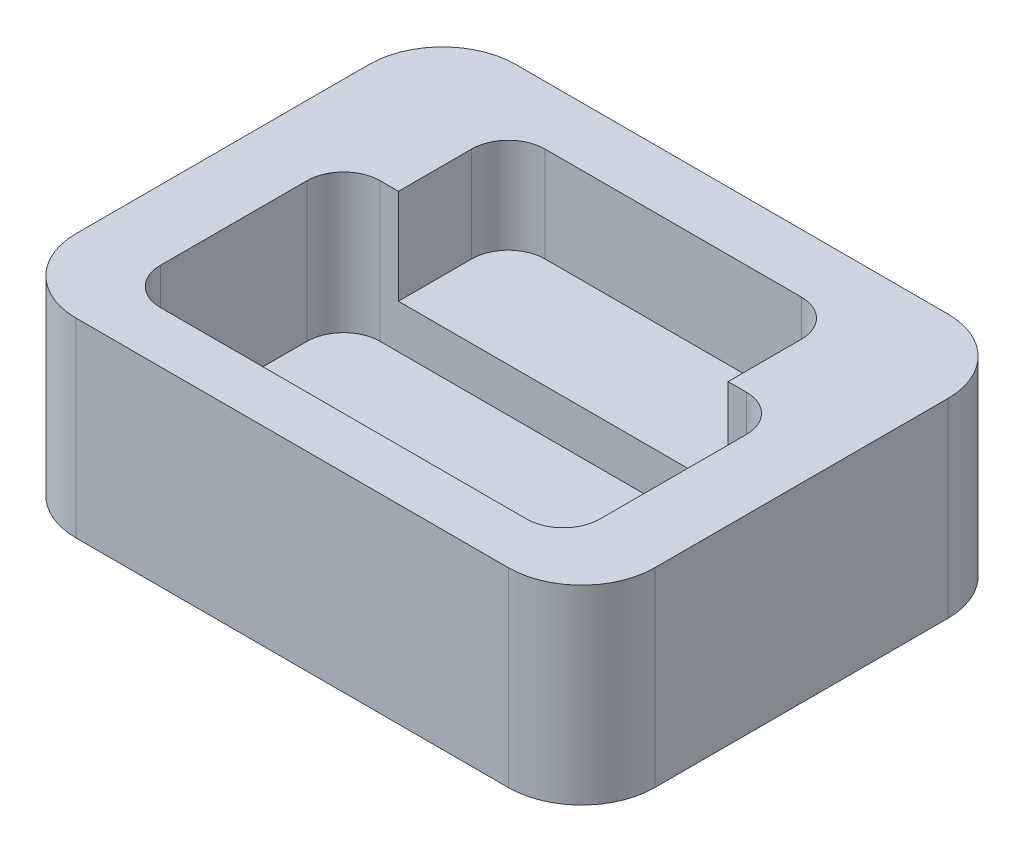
ISO-10303-21;
HEADER;
FILE_DESCRIPTION(('STEP AP214'),'2;1');
FILE_NAME('part.step','',(''),(''),'','','');
FILE_SCHEMA(('AUTOMOTIVE_DESIGN { 1 0 10303 214 1 1 1 1 }'));
ENDSEC;
DATA;
#1=APPLICATION_CONTEXT('core data for automotive mechanical design processes');
#2=APPLICATION_PROTOCOL_DEFINITION('international standard','automotive_design',2000,#1);
#3=PRODUCT_CONTEXT('',#1,'mechanical');
#4=PRODUCT('Part','Part','',(#3));
#5=PRODUCT_RELATED_PRODUCT_CATEGORY('part','',(#4));
#6=PRODUCT_DEFINITION_FORMATION('','',#4);
#7=PRODUCT_DEFINITION_CONTEXT('part definition',#1,'design');
#8=PRODUCT_DEFINITION('design','',#6,#7);
#9=PRODUCT_DEFINITION_SHAPE('','',#8);
#10=(LENGTH_UNIT() NAMED_UNIT(*) SI_UNIT(.MILLI.,.METRE.));
#11=(NAMED_UNIT(*) PLANE_ANGLE_UNIT() SI_UNIT($,.RADIAN.));
#12=(NAMED_UNIT(*) SI_UNIT($,.STERADIAN.) SOLID_ANGLE_UNIT());
#13=UNCERTAINTY_MEASURE_WITH_UNIT(LENGTH_MEASURE(1.E-05),#10,'distance_accuracy_value','');
#14=(GEOMETRIC_REPRESENTATION_CONTEXT(3) GLOBAL_UNCERTAINTY_ASSIGNED_CONTEXT((#13)) GLOBAL_UNIT_ASSIGNED_CONTEXT((#10,
#11,#12)) REPRESENTATION_CONTEXT('',''));
#15=CARTESIAN_POINT('',(0.,0.,0.));
#16=DIRECTION('',(0.,0.,1.));
#17=DIRECTION('',(1.,0.,0.));
#18=AXIS2_PLACEMENT_3D('',#15,#16,#17);
#19=CARTESIAN_POINT('',(0.,26.,0.));
#20=DIRECTION('',(0.,1.,0.));
#21=DIRECTION('',(0.,0.,1.));
#22=AXIS2_PLACEMENT_3D('',#19,#20,#21);
#23=PLANE('',#22);
#24=DIRECTION('',(0.,0.,-1.));
#25=VECTOR('',#24,1.);
#26=CARTESIAN_POINT('',(25.6279926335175,26.,0.));
#27=LINE('',#26,#25);
#28=CARTESIAN_POINT('',(25.6279926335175,26.,7.9419889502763));
#29=VERTEX_POINT('',#28);
#30=CARTESIAN_POINT('',(25.6279926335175,26.,-2.05801104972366));
#31=VERTEX_POINT('',#30);
#32=EDGE_CURVE('E303',#29,#31,#27,.T.);
#33=ORIENTED_EDGE('',*,*,#32,.F.);
#34=DIRECTION('',(-1.,0.,0.));
#35=VECTOR('',#34,1.);
#36=CARTESIAN_POINT('',(0.,26.,7.9419889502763));
#37=LINE('',#36,#35);
#38=CARTESIAN_POINT('',(28.1279926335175,26.,7.9419889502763));
#39=VERTEX_POINT('',#38);
#40=EDGE_CURVE('E334',#39,#29,#37,.T.);
#41=ORIENTED_EDGE('',*,*,#40,.F.);
#42=CARTESIAN_POINT('',(28.1279926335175,26.,12.9419889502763));
#43=DIRECTION('',(0.,1.,0.));
#44=DIRECTION('',(0.,0.,1.));
#45=AXIS2_PLACEMENT_3D('',#42,#43,#44);
#46=CIRCLE('',#45,5.);
#47=CARTESIAN_POINT('',(33.1279926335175,26.,12.9419889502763));
#48=VERTEX_POINT('',#47);
#49=EDGE_CURVE('E330',#48,#39,#46,.T.);
#50=ORIENTED_EDGE('',*,*,#49,.F.);
#51=DIRECTION('',(0.,0.,-1.));
#52=VECTOR('',#51,1.);
#53=CARTESIAN_POINT('',(33.1279926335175,26.,0.));
#54=LINE('',#53,#52);
#55=CARTESIAN_POINT('',(33.1279926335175,26.,32.9419889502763));
#56=VERTEX_POINT('',#55);
#57=EDGE_CURVE('E327',#56,#48,#54,.T.);
#58=ORIENTED_EDGE('',*,*,#57,.F.);
#59=CARTESIAN_POINT('',(28.1279926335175,26.,32.9419889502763));
#60=DIRECTION('',(0.,1.,0.));
#61=DIRECTION('',(0.,0.,1.));
#62=AXIS2_PLACEMENT_3D('',#59,#60,#61);
#63=CIRCLE('',#62,5.);
#64=CARTESIAN_POINT('',(28.1279926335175,26.,37.9419889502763));
#65=VERTEX_POINT('',#64);
#66=EDGE_CURVE('E325',#65,#56,#63,.T.);
#67=ORIENTED_EDGE('',*,*,#66,.F.);
#68=DIRECTION('',(-1.,0.,0.));
#69=VECTOR('',#68,1.);
#70=CARTESIAN_POINT('',(0.,26.,37.9419889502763));
#71=LINE('',#70,#69);
#72=CARTESIAN_POINT('',(-21.8720073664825,26.,37.9419889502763));
#73=VERTEX_POINT('',#72);
#74=EDGE_CURVE('E116',#65,#73,#71,.T.);
#75=ORIENTED_EDGE('',*,*,#74,.T.);
#76=CARTESIAN_POINT('',(-21.8720073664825,26.,32.9419889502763));
#77=DIRECTION('',(0.,1.,0.));
#78=DIRECTION('',(0.,0.,1.));
#79=AXIS2_PLACEMENT_3D('',#76,#77,#78);
#80=CIRCLE('',#79,5.);
#81=CARTESIAN_POINT('',(-26.8720073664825,26.,32.9419889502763));
#82=VERTEX_POINT('',#81);
#83=EDGE_CURVE('E249',#73,#82,#80,.F.);
#84=ORIENTED_EDGE('',*,*,#83,.T.);
#85=DIRECTION('',(0.,0.,-1.));
#86=VECTOR('',#85,1.);
#87=CARTESIAN_POINT('',(-26.8720073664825,26.,0.));
#88=LINE('',#87,#86);
#89=CARTESIAN_POINT('',(-26.8720073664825,26.,12.9419889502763));
#90=VERTEX_POINT('',#89);
#91=EDGE_CURVE('E340',#82,#90,#88,.T.);
#92=ORIENTED_EDGE('',*,*,#91,.T.);
#93=CARTESIAN_POINT('',(-21.8720073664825,26.,12.9419889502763));
#94=DIRECTION('',(0.,1.,0.));
#95=DIRECTION('',(0.,0.,1.));
#96=AXIS2_PLACEMENT_3D('',#93,#94,#95);
#97=CIRCLE('',#96,5.);
#98=CARTESIAN_POINT('',(-21.8720073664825,26.,7.94198895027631));
#99=VERTEX_POINT('',#98);
#100=EDGE_CURVE('E337',#90,#99,#97,.F.);
#101=ORIENTED_EDGE('',*,*,#100,.T.);
#102=CARTESIAN_POINT('',(-19.3720073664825,26.,7.94198895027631));
#103=VERTEX_POINT('',#102);
#104=EDGE_CURVE('E333',#103,#99,#37,.T.);
#105=ORIENTED_EDGE('',*,*,#104,.F.);
#106=DIRECTION('',(0.,0.,-1.));
#107=VECTOR('',#106,1.);
#108=CARTESIAN_POINT('',(-19.3720073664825,26.,0.));
#109=LINE('',#108,#107);
#110=CARTESIAN_POINT('',(-19.3720073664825,26.,-2.05801104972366));
#111=VERTEX_POINT('',#110);
#112=EDGE_CURVE('E300',#103,#111,#109,.T.);
#113=ORIENTED_EDGE('',*,*,#112,.T.);
#114=CARTESIAN_POINT('',(-14.3720073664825,26.,-2.05801104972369));
#115=DIRECTION('',(0.,1.,0.));
#116=DIRECTION('',(0.,0.,1.));
#117=AXIS2_PLACEMENT_3D('',#114,#115,#116);
#118=CIRCLE('',#117,5.);
#119=CARTESIAN_POINT('',(-14.3720073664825,26.,-7.05801104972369));
#120=VERTEX_POINT('',#119);
#121=EDGE_CURVE('E280',#111,#120,#118,.F.);
#122=ORIENTED_EDGE('',*,*,#121,.T.);
#123=DIRECTION('',(1.,0.,0.));
#124=VECTOR('',#123,1.);
#125=CARTESIAN_POINT('',(0.,26.,-7.05801104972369));
#126=LINE('',#125,#124);
#127=CARTESIAN_POINT('',(20.6279926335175,26.,-7.05801104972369));
#128=VERTEX_POINT('',#127);
#129=EDGE_CURVE('E284',#120,#128,#126,.T.);
#130=ORIENTED_EDGE('',*,*,#129,.T.);
#131=CARTESIAN_POINT('',(20.6279926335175,26.,-2.05801104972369));
#132=DIRECTION('',(0.,1.,0.));
#133=DIRECTION('',(0.,0.,1.));
#134=AXIS2_PLACEMENT_3D('',#131,#132,#133);
#135=CIRCLE('',#134,5.);
#136=EDGE_CURVE('E306',#31,#128,#135,.T.);
#137=ORIENTED_EDGE('',*,*,#136,.F.);
#138=EDGE_LOOP('',(#33,#41,#50,#58,#67,#75,#84,#92,#101,#105,#113,#122,#130,#137));
#139=FACE_BOUND('',#138,.T.);
#140=CARTESIAN_POINT('',(-26.3720073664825,26.,-5.0580110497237));
#141=DIRECTION('',(0.,1.,0.));
#142=DIRECTION('',(0.,0.,1.));
#143=AXIS2_PLACEMENT_3D('',#140,#141,#142);
#144=CIRCLE('',#143,10.);
#145=CARTESIAN_POINT('',(-36.3720073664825,26.,-5.05801104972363));
#146=VERTEX_POINT('',#145);
#147=CARTESIAN_POINT('',(-26.3720073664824,26.,-15.0580110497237));
#148=VERTEX_POINT('',#147);
#149=EDGE_CURVE('E360',#146,#148,#144,.F.);
#150=ORIENTED_EDGE('',*,*,#149,.F.);
#151=DIRECTION('',(0.,0.,1.));
#152=VECTOR('',#151,1.);
#153=CARTESIAN_POINT('',(-36.3720073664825,26.,0.));
#154=LINE('',#153,#152);
#155=CARTESIAN_POINT('',(-36.3720073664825,26.,34.9419889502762));
#156=VERTEX_POINT('',#155);
#157=EDGE_CURVE('E363',#146,#156,#154,.T.);
#158=ORIENTED_EDGE('',*,*,#157,.T.);
#159=CARTESIAN_POINT('',(-26.3720073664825,26.,34.9419889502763));
#160=DIRECTION('',(0.,1.,0.));
#161=DIRECTION('',(0.,0.,1.));
#162=AXIS2_PLACEMENT_3D('',#159,#160,#161);
#163=CIRCLE('',#162,10.);
#164=CARTESIAN_POINT('',(-26.3720073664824,26.,44.9419889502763));
#165=VERTEX_POINT('',#164);
#166=EDGE_CURVE('E366',#156,#165,#163,.T.);
#167=ORIENTED_EDGE('',*,*,#166,.T.);
#168=DIRECTION('',(1.,0.,0.));
#169=VECTOR('',#168,1.);
#170=CARTESIAN_POINT('',(0.,26.,44.9419889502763));
#171=LINE('',#170,#169);
#172=CARTESIAN_POINT('',(32.6279926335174,26.,44.9419889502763));
#173=VERTEX_POINT('',#172);
#174=EDGE_CURVE('E368',#165,#173,#171,.T.);
#175=ORIENTED_EDGE('',*,*,#174,.T.);
#176=CARTESIAN_POINT('',(32.6279926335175,26.,34.9419889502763));
#177=DIRECTION('',(0.,1.,0.));
#178=DIRECTION('',(0.,0.,1.));
#179=AXIS2_PLACEMENT_3D('',#176,#177,#178);
#180=CIRCLE('',#179,10.);
#181=CARTESIAN_POINT('',(42.6279926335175,26.,34.9419889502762));
#182=VERTEX_POINT('',#181);
#183=EDGE_CURVE('E370',#173,#182,#180,.T.);
#184=ORIENTED_EDGE('',*,*,#183,.T.);
#185=DIRECTION('',(0.,0.,1.));
#186=VECTOR('',#185,1.);
#187=CARTESIAN_POINT('',(42.6279926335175,26.,0.));
#188=LINE('',#187,#186);
#189=CARTESIAN_POINT('',(42.6279926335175,26.,-5.05801104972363));
#190=VERTEX_POINT('',#189);
#191=EDGE_CURVE('E372',#190,#182,#188,.T.);
#192=ORIENTED_EDGE('',*,*,#191,.F.);
#193=CARTESIAN_POINT('',(32.6279926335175,26.,-5.0580110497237));
#194=DIRECTION('',(0.,1.,0.));
#195=DIRECTION('',(0.,0.,1.));
#196=AXIS2_PLACEMENT_3D('',#193,#194,#195);
#197=CIRCLE('',#196,10.);
#198=CARTESIAN_POINT('',(32.6279926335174,26.,-15.0580110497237));
#199=VERTEX_POINT('',#198);
#200=EDGE_CURVE('E375',#190,#199,#197,.T.);
#201=ORIENTED_EDGE('',*,*,#200,.T.);
#202=DIRECTION('',(1.,0.,0.));
#203=VECTOR('',#202,1.);
#204=CARTESIAN_POINT('',(0.,26.,-15.0580110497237));
#205=LINE('',#204,#203);
#206=EDGE_CURVE('E377',#148,#199,#205,.T.);
#207=ORIENTED_EDGE('',*,*,#206,.F.);
#208=EDGE_LOOP('',(#150,#158,#167,#175,#184,#192,#201,#207));
#209=FACE_BOUND('',#208,.T.);
#210=ADVANCED_FACE('F93',(#139,#209),#23,.T.);
#211=CARTESIAN_POINT('',(0.,26.,-15.0580110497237));
#212=DIRECTION('',(0.,0.,-1.));
#213=DIRECTION('',(-1.,0.,0.));
#214=AXIS2_PLACEMENT_3D('',#211,#212,#213);
#215=PLANE('',#214);
#216=DIRECTION('',(1.,0.,0.));
#217=VECTOR('',#216,1.);
#218=CARTESIAN_POINT('',(0.,0.,-15.0580110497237));
#219=LINE('',#218,#217);
#220=CARTESIAN_POINT('',(-26.3720073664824,0.,-15.0580110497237));
#221=VERTEX_POINT('',#220);
#222=CARTESIAN_POINT('',(32.6279926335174,0.,-15.0580110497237));
#223=VERTEX_POINT('',#222);
#224=EDGE_CURVE('E364',#221,#223,#219,.T.);
#225=ORIENTED_EDGE('',*,*,#224,.F.);
#226=DIRECTION('',(0.,-1.,0.));
#227=VECTOR('',#226,1.);
#228=CARTESIAN_POINT('',(-26.3720073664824,26.,-15.0580110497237));
#229=LINE('',#228,#227);
#230=EDGE_CURVE('E380',#148,#221,#229,.T.);
#231=ORIENTED_EDGE('',*,*,#230,.F.);
#232=ORIENTED_EDGE('',*,*,#206,.T.);
#233=DIRECTION('',(0.,-1.,0.));
#234=VECTOR('',#233,1.);
#235=CARTESIAN_POINT('',(32.6279926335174,26.,-15.0580110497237));
#236=LINE('',#235,#234);
#237=EDGE_CURVE('E401',#199,#223,#236,.T.);
#238=ORIENTED_EDGE('',*,*,#237,.T.);
#239=EDGE_LOOP('',(#225,#231,#232,#238));
#240=FACE_BOUND('',#239,.T.);
#241=ADVANCED_FACE('F444',(#240),#215,.T.);
#242=CARTESIAN_POINT('',(0.,0.,0.));
#243=DIRECTION('',(0.,1.,0.));
#244=DIRECTION('',(0.,0.,1.));
#245=AXIS2_PLACEMENT_3D('',#242,#243,#244);
#246=PLANE('',#245);
#247=CARTESIAN_POINT('',(-26.3720073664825,0.,-5.0580110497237));
#248=DIRECTION('',(0.,1.,0.));
#249=DIRECTION('',(0.,0.,1.));
#250=AXIS2_PLACEMENT_3D('',#247,#248,#249);
#251=CIRCLE('',#250,10.);
#252=CARTESIAN_POINT('',(-36.3720073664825,0.,-5.05801104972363));
#253=VERTEX_POINT('',#252);
#254=EDGE_CURVE('E347',#253,#221,#251,.F.);
#255=ORIENTED_EDGE('',*,*,#254,.T.);
#256=ORIENTED_EDGE('',*,*,#224,.T.);
#257=CARTESIAN_POINT('',(32.6279926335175,0.,-5.0580110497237));
#258=DIRECTION('',(0.,1.,0.));
#259=DIRECTION('',(0.,0.,1.));
#260=AXIS2_PLACEMENT_3D('',#257,#258,#259);
#261=CIRCLE('',#260,10.);
#262=CARTESIAN_POINT('',(42.6279926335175,0.,-5.05801104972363));
#263=VERTEX_POINT('',#262);
#264=EDGE_CURVE('E395',#263,#223,#261,.T.);
#265=ORIENTED_EDGE('',*,*,#264,.F.);
#266=DIRECTION('',(0.,0.,1.));
#267=VECTOR('',#266,1.);
#268=CARTESIAN_POINT('',(42.6279926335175,0.,0.));
#269=LINE('',#268,#267);
#270=CARTESIAN_POINT('',(42.6279926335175,0.,34.9419889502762));
#271=VERTEX_POINT('',#270);
#272=EDGE_CURVE('E392',#263,#271,#269,.T.);
#273=ORIENTED_EDGE('',*,*,#272,.T.);
#274=CARTESIAN_POINT('',(32.6279926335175,0.,34.9419889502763));
#275=DIRECTION('',(0.,1.,0.));
#276=DIRECTION('',(0.,0.,1.));
#277=AXIS2_PLACEMENT_3D('',#274,#275,#276);
#278=CIRCLE('',#277,10.);
#279=CARTESIAN_POINT('',(32.6279926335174,0.,44.9419889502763));
#280=VERTEX_POINT('',#279);
#281=EDGE_CURVE('E389',#280,#271,#278,.T.);
#282=ORIENTED_EDGE('',*,*,#281,.F.);
#283=DIRECTION('',(1.,0.,0.));
#284=VECTOR('',#283,1.);
#285=CARTESIAN_POINT('',(0.,0.,44.9419889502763));
#286=LINE('',#285,#284);
#287=CARTESIAN_POINT('',(-26.3720073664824,0.,44.9419889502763));
#288=VERTEX_POINT('',#287);
#289=EDGE_CURVE('E387',#288,#280,#286,.T.);
#290=ORIENTED_EDGE('',*,*,#289,.F.);
#291=CARTESIAN_POINT('',(-26.3720073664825,0.,34.9419889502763));
#292=DIRECTION('',(0.,1.,0.));
#293=DIRECTION('',(0.,0.,1.));
#294=AXIS2_PLACEMENT_3D('',#291,#292,#293);
#295=CIRCLE('',#294,10.);
#296=CARTESIAN_POINT('',(-36.3720073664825,0.,34.9419889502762));
#297=VERTEX_POINT('',#296);
#298=EDGE_CURVE('E385',#297,#288,#295,.T.);
#299=ORIENTED_EDGE('',*,*,#298,.F.);
#300=DIRECTION('',(0.,0.,1.));
#301=VECTOR('',#300,1.);
#302=CARTESIAN_POINT('',(-36.3720073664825,0.,0.));
#303=LINE('',#302,#301);
#304=EDGE_CURVE('E383',#253,#297,#303,.T.);
#305=ORIENTED_EDGE('',*,*,#304,.F.);
#306=EDGE_LOOP('',(#255,#256,#265,#273,#282,#290,#299,#305));
#307=FACE_BOUND('',#306,.T.);
#308=ADVANCED_FACE('F424',(#307),#246,.F.);
#309=CARTESIAN_POINT('',(32.6279926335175,26.,-5.0580110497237));
#310=DIRECTION('',(0.,-1.,0.));
#311=DIRECTION('',(0.,0.,-1.));
#312=AXIS2_PLACEMENT_3D('',#309,#310,#311);
#313=CYLINDRICAL_SURFACE('',#312,10.);
#314=ORIENTED_EDGE('',*,*,#264,.T.);
#315=ORIENTED_EDGE('',*,*,#237,.F.);
#316=ORIENTED_EDGE('',*,*,#200,.F.);
#317=DIRECTION('',(0.,-1.,0.));
#318=VECTOR('',#317,1.);
#319=CARTESIAN_POINT('',(42.6279926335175,26.,-5.05801104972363));
#320=LINE('',#319,#318);
#321=EDGE_CURVE('E403',#190,#263,#320,.T.);
#322=ORIENTED_EDGE('',*,*,#321,.T.);
#323=EDGE_LOOP('',(#314,#315,#316,#322));
#324=FACE_BOUND('',#323,.T.);
#325=ADVANCED_FACE('F448',(#324),#313,.T.);
#326=CARTESIAN_POINT('',(42.6279926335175,26.,0.));
#327=DIRECTION('',(1.,0.,0.));
#328=DIRECTION('',(0.,0.,-1.));
#329=AXIS2_PLACEMENT_3D('',#326,#327,#328);
#330=PLANE('',#329);
#331=ORIENTED_EDGE('',*,*,#272,.F.);
#332=ORIENTED_EDGE('',*,*,#321,.F.);
#333=ORIENTED_EDGE('',*,*,#191,.T.);
#334=DIRECTION('',(0.,-1.,0.));
#335=VECTOR('',#334,1.);
#336=CARTESIAN_POINT('',(42.6279926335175,26.,34.9419889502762));
#337=LINE('',#336,#335);
#338=EDGE_CURVE('E405',#182,#271,#337,.T.);
#339=ORIENTED_EDGE('',*,*,#338,.T.);
#340=EDGE_LOOP('',(#331,#332,#333,#339));
#341=FACE_BOUND('',#340,.T.);
#342=ADVANCED_FACE('F451',(#341),#330,.T.);
#343=CARTESIAN_POINT('',(32.6279926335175,26.,34.9419889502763));
#344=DIRECTION('',(0.,-1.,0.));
#345=DIRECTION('',(0.,0.,-1.));
#346=AXIS2_PLACEMENT_3D('',#343,#344,#345);
#347=CYLINDRICAL_SURFACE('',#346,10.);
#348=ORIENTED_EDGE('',*,*,#281,.T.);
#349=ORIENTED_EDGE('',*,*,#338,.F.);
#350=ORIENTED_EDGE('',*,*,#183,.F.);
#351=DIRECTION('',(0.,-1.,0.));
#352=VECTOR('',#351,1.);
#353=CARTESIAN_POINT('',(32.6279926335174,26.,44.9419889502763));
#354=LINE('',#353,#352);
#355=EDGE_CURVE('E407',#173,#280,#354,.T.);
#356=ORIENTED_EDGE('',*,*,#355,.T.);
#357=EDGE_LOOP('',(#348,#349,#350,#356));
#358=FACE_BOUND('',#357,.T.);
#359=ADVANCED_FACE('F433',(#358),#347,.T.);
#360=CARTESIAN_POINT('',(0.,26.,44.9419889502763));
#361=DIRECTION('',(0.,0.,-1.));
#362=DIRECTION('',(-1.,0.,0.));
#363=AXIS2_PLACEMENT_3D('',#360,#361,#362);
#364=PLANE('',#363);
#365=ORIENTED_EDGE('',*,*,#289,.T.);
#366=ORIENTED_EDGE('',*,*,#355,.F.);
#367=ORIENTED_EDGE('',*,*,#174,.F.);
#368=DIRECTION('',(0.,-1.,0.));
#369=VECTOR('',#368,1.);
#370=CARTESIAN_POINT('',(-26.3720073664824,26.,44.9419889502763));
#371=LINE('',#370,#369);
#372=EDGE_CURVE('E410',#165,#288,#371,.T.);
#373=ORIENTED_EDGE('',*,*,#372,.T.);
#374=EDGE_LOOP('',(#365,#366,#367,#373));
#375=FACE_BOUND('',#374,.T.);
#376=ADVANCED_FACE('F429',(#375),#364,.F.);
#377=CARTESIAN_POINT('',(-26.3720073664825,26.,34.9419889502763));
#378=DIRECTION('',(0.,-1.,0.));
#379=DIRECTION('',(0.,0.,-1.));
#380=AXIS2_PLACEMENT_3D('',#377,#378,#379);
#381=CYLINDRICAL_SURFACE('',#380,10.);
#382=ORIENTED_EDGE('',*,*,#298,.T.);
#383=ORIENTED_EDGE('',*,*,#372,.F.);
#384=ORIENTED_EDGE('',*,*,#166,.F.);
#385=DIRECTION('',(0.,-1.,0.));
#386=VECTOR('',#385,1.);
#387=CARTESIAN_POINT('',(-36.3720073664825,26.,34.9419889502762));
#388=LINE('',#387,#386);
#389=EDGE_CURVE('E101',#156,#297,#388,.T.);
#390=ORIENTED_EDGE('',*,*,#389,.T.);
#391=EDGE_LOOP('',(#382,#383,#384,#390));
#392=FACE_BOUND('',#391,.T.);
#393=ADVANCED_FACE('F417',(#392),#381,.T.);
#394=CARTESIAN_POINT('',(-36.3720073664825,26.,0.));
#395=DIRECTION('',(1.,0.,0.));
#396=DIRECTION('',(0.,0.,-1.));
#397=AXIS2_PLACEMENT_3D('',#394,#395,#396);
#398=PLANE('',#397);
#399=ORIENTED_EDGE('',*,*,#304,.T.);
#400=ORIENTED_EDGE('',*,*,#389,.F.);
#401=ORIENTED_EDGE('',*,*,#157,.F.);
#402=DIRECTION('',(0.,-1.,0.));
#403=VECTOR('',#402,1.);
#404=CARTESIAN_POINT('',(-36.3720073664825,26.,-5.05801104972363));
#405=LINE('',#404,#403);
#406=EDGE_CURVE('E12',#146,#253,#405,.T.);
#407=ORIENTED_EDGE('',*,*,#406,.T.);
#408=EDGE_LOOP('',(#399,#400,#401,#407));
#409=FACE_BOUND('',#408,.T.);
#410=ADVANCED_FACE('F439',(#409),#398,.F.);
#411=CARTESIAN_POINT('',(-26.3720073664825,26.,-5.0580110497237));
#412=DIRECTION('',(0.,-1.,0.));
#413=DIRECTION('',(0.,0.,-1.));
#414=AXIS2_PLACEMENT_3D('',#411,#412,#413);
#415=CYLINDRICAL_SURFACE('',#414,10.);
#416=ORIENTED_EDGE('',*,*,#254,.F.);
#417=ORIENTED_EDGE('',*,*,#406,.F.);
#418=ORIENTED_EDGE('',*,*,#149,.T.);
#419=ORIENTED_EDGE('',*,*,#230,.T.);
#420=EDGE_LOOP('',(#416,#417,#418,#419));
#421=FACE_BOUND('',#420,.T.);
#422=ADVANCED_FACE('F95',(#421),#415,.T.);
#423=CARTESIAN_POINT('',(0.,11.,37.9419889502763));
#424=DIRECTION('',(0.,0.,-1.));
#425=DIRECTION('',(-1.,0.,0.));
#426=AXIS2_PLACEMENT_3D('',#423,#424,#425);
#427=PLANE('',#426);
#428=ORIENTED_EDGE('',*,*,#74,.F.);
#429=DIRECTION('',(0.,1.,0.));
#430=VECTOR('',#429,1.);
#431=CARTESIAN_POINT('',(28.1279926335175,11.,37.9419889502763));
#432=LINE('',#431,#430);
#433=CARTESIAN_POINT('',(28.1279926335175,7.,37.9419889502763));
#434=VERTEX_POINT('',#433);
#435=EDGE_CURVE('E240',#434,#65,#432,.T.);
#436=ORIENTED_EDGE('',*,*,#435,.F.);
#437=DIRECTION('',(-1.,0.,0.));
#438=VECTOR('',#437,1.);
#439=CARTESIAN_POINT('',(0.,7.,37.9419889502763));
#440=LINE('',#439,#438);
#441=CARTESIAN_POINT('',(-21.8720073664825,7.,37.9419889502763));
#442=VERTEX_POINT('',#441);
#443=EDGE_CURVE('E243',#434,#442,#440,.T.);
#444=ORIENTED_EDGE('',*,*,#443,.T.);
#445=DIRECTION('',(0.,1.,0.));
#446=VECTOR('',#445,1.);
#447=CARTESIAN_POINT('',(-21.8720073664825,11.,37.9419889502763));
#448=LINE('',#447,#446);
#449=EDGE_CURVE('E345',#442,#73,#448,.T.);
#450=ORIENTED_EDGE('',*,*,#449,.T.);
#451=EDGE_LOOP('',(#428,#436,#444,#450));
#452=FACE_BOUND('',#451,.T.);
#453=ADVANCED_FACE('F242',(#452),#427,.T.);
#454=CARTESIAN_POINT('',(-21.8720073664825,11.,32.9419889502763));
#455=DIRECTION('',(0.,1.,0.));
#456=DIRECTION('',(0.,0.,1.));
#457=AXIS2_PLACEMENT_3D('',#454,#455,#456);
#458=CYLINDRICAL_SURFACE('',#457,5.);
#459=ORIENTED_EDGE('',*,*,#83,.F.);
#460=ORIENTED_EDGE('',*,*,#449,.F.);
#461=CARTESIAN_POINT('',(-21.8720073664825,7.,32.9419889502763));
#462=DIRECTION('',(0.,1.,0.));
#463=DIRECTION('',(0.,0.,1.));
#464=AXIS2_PLACEMENT_3D('',#461,#462,#463);
#465=CIRCLE('',#464,5.);
#466=CARTESIAN_POINT('',(-26.8720073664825,7.,32.9419889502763));
#467=VERTEX_POINT('',#466);
#468=EDGE_CURVE('E259',#442,#467,#465,.F.);
#469=ORIENTED_EDGE('',*,*,#468,.T.);
#470=DIRECTION('',(0.,1.,0.));
#471=VECTOR('',#470,1.);
#472=CARTESIAN_POINT('',(-26.8720073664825,11.,32.9419889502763));
#473=LINE('',#472,#471);
#474=EDGE_CURVE('E348',#467,#82,#473,.T.);
#475=ORIENTED_EDGE('',*,*,#474,.T.);
#476=EDGE_LOOP('',(#459,#460,#469,#475));
#477=FACE_BOUND('',#476,.T.);
#478=ADVANCED_FACE('F609',(#477),#458,.F.);
#479=CARTESIAN_POINT('',(-26.8720073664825,11.,0.));
#480=DIRECTION('',(1.,0.,0.));
#481=DIRECTION('',(0.,0.,-1.));
#482=AXIS2_PLACEMENT_3D('',#479,#480,#481);
#483=PLANE('',#482);
#484=ORIENTED_EDGE('',*,*,#91,.F.);
#485=ORIENTED_EDGE('',*,*,#474,.F.);
#486=DIRECTION('',(0.,0.,-1.));
#487=VECTOR('',#486,1.);
#488=CARTESIAN_POINT('',(-26.8720073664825,7.,0.));
#489=LINE('',#488,#487);
#490=CARTESIAN_POINT('',(-26.8720073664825,7.,12.9419889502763));
#491=VERTEX_POINT('',#490);
#492=EDGE_CURVE('E276',#467,#491,#489,.T.);
#493=ORIENTED_EDGE('',*,*,#492,.T.);
#494=DIRECTION('',(0.,1.,0.));
#495=VECTOR('',#494,1.);
#496=CARTESIAN_POINT('',(-26.8720073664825,11.,12.9419889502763));
#497=LINE('',#496,#495);
#498=EDGE_CURVE('E350',#491,#90,#497,.T.);
#499=ORIENTED_EDGE('',*,*,#498,.T.);
#500=EDGE_LOOP('',(#484,#485,#493,#499));
#501=FACE_BOUND('',#500,.T.);
#502=ADVANCED_FACE('F618',(#501),#483,.T.);
#503=CARTESIAN_POINT('',(-21.8720073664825,11.,12.9419889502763));
#504=DIRECTION('',(0.,1.,0.));
#505=DIRECTION('',(0.,0.,1.));
#506=AXIS2_PLACEMENT_3D('',#503,#504,#505);
#507=CYLINDRICAL_SURFACE('',#506,5.);
#508=ORIENTED_EDGE('',*,*,#100,.F.);
#509=ORIENTED_EDGE('',*,*,#498,.F.);
#510=CARTESIAN_POINT('',(-21.8720073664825,7.,12.9419889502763));
#511=DIRECTION('',(0.,1.,0.));
#512=DIRECTION('',(0.,0.,1.));
#513=AXIS2_PLACEMENT_3D('',#510,#511,#512);
#514=CIRCLE('',#513,5.);
#515=CARTESIAN_POINT('',(-21.8720073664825,7.,7.94198895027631));
#516=VERTEX_POINT('',#515);
#517=EDGE_CURVE('E273',#491,#516,#514,.F.);
#518=ORIENTED_EDGE('',*,*,#517,.T.);
#519=DIRECTION('',(0.,1.,0.));
#520=VECTOR('',#519,1.);
#521=CARTESIAN_POINT('',(-21.8720073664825,11.,7.94198895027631));
#522=LINE('',#521,#520);
#523=EDGE_CURVE('E352',#516,#99,#522,.T.);
#524=ORIENTED_EDGE('',*,*,#523,.T.);
#525=EDGE_LOOP('',(#508,#509,#518,#524));
#526=FACE_BOUND('',#525,.T.);
#527=ADVANCED_FACE('F629',(#526),#507,.F.);
#528=CARTESIAN_POINT('',(0.,11.,7.9419889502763));
#529=DIRECTION('',(0.,0.,-1.));
#530=DIRECTION('',(-1.,0.,0.));
#531=AXIS2_PLACEMENT_3D('',#528,#529,#530);
#532=PLANE('',#531);
#533=ORIENTED_EDGE('',*,*,#40,.T.);
#534=DIRECTION('',(0.,1.,0.));
#535=VECTOR('',#534,1.);
#536=CARTESIAN_POINT('',(25.6279926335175,13.,7.9419889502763));
#537=LINE('',#536,#535);
#538=CARTESIAN_POINT('',(25.6279926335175,13.,7.9419889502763));
#539=VERTEX_POINT('',#538);
#540=EDGE_CURVE('E318',#539,#29,#537,.T.);
#541=ORIENTED_EDGE('',*,*,#540,.F.);
#542=DIRECTION('',(-1.,0.,0.));
#543=VECTOR('',#542,1.);
#544=CARTESIAN_POINT('',(0.,13.,7.9419889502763));
#545=LINE('',#544,#543);
#546=CARTESIAN_POINT('',(-19.3720073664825,13.,7.94198895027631));
#547=VERTEX_POINT('',#546);
#548=EDGE_CURVE('E286',#539,#547,#545,.T.);
#549=ORIENTED_EDGE('',*,*,#548,.T.);
#550=DIRECTION('',(0.,1.,0.));
#551=VECTOR('',#550,1.);
#552=CARTESIAN_POINT('',(-19.3720073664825,13.,7.94198895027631));
#553=LINE('',#552,#551);
#554=EDGE_CURVE('E320',#547,#103,#553,.T.);
#555=ORIENTED_EDGE('',*,*,#554,.T.);
#556=ORIENTED_EDGE('',*,*,#104,.T.);
#557=ORIENTED_EDGE('',*,*,#523,.F.);
#558=DIRECTION('',(-1.,0.,0.));
#559=VECTOR('',#558,1.);
#560=CARTESIAN_POINT('',(0.,7.,7.9419889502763));
#561=LINE('',#560,#559);
#562=CARTESIAN_POINT('',(28.1279926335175,7.,7.9419889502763));
#563=VERTEX_POINT('',#562);
#564=EDGE_CURVE('E270',#563,#516,#561,.T.);
#565=ORIENTED_EDGE('',*,*,#564,.F.);
#566=DIRECTION('',(0.,1.,0.));
#567=VECTOR('',#566,1.);
#568=CARTESIAN_POINT('',(28.1279926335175,11.,7.9419889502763));
#569=LINE('',#568,#567);
#570=EDGE_CURVE('E355',#563,#39,#569,.T.);
#571=ORIENTED_EDGE('',*,*,#570,.T.);
#572=EDGE_LOOP('',(#533,#541,#549,#555,#556,#557,#565,#571));
#573=FACE_BOUND('',#572,.T.);
#574=ADVANCED_FACE('F640',(#573),#532,.F.);
#575=CARTESIAN_POINT('',(28.1279926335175,11.,12.9419889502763));
#576=DIRECTION('',(0.,1.,0.));
#577=DIRECTION('',(0.,0.,1.));
#578=AXIS2_PLACEMENT_3D('',#575,#576,#577);
#579=CYLINDRICAL_SURFACE('',#578,5.);
#580=ORIENTED_EDGE('',*,*,#49,.T.);
#581=ORIENTED_EDGE('',*,*,#570,.F.);
#582=CARTESIAN_POINT('',(28.1279926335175,7.,12.9419889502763));
#583=DIRECTION('',(0.,1.,0.));
#584=DIRECTION('',(0.,0.,1.));
#585=AXIS2_PLACEMENT_3D('',#582,#583,#584);
#586=CIRCLE('',#585,5.);
#587=CARTESIAN_POINT('',(33.1279926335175,7.,12.9419889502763));
#588=VERTEX_POINT('',#587);
#589=EDGE_CURVE('E265',#588,#563,#586,.T.);
#590=ORIENTED_EDGE('',*,*,#589,.F.);
#591=DIRECTION('',(0.,1.,0.));
#592=VECTOR('',#591,1.);
#593=CARTESIAN_POINT('',(33.1279926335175,11.,12.9419889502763));
#594=LINE('',#593,#592);
#595=EDGE_CURVE('E357',#588,#48,#594,.T.);
#596=ORIENTED_EDGE('',*,*,#595,.T.);
#597=EDGE_LOOP('',(#580,#581,#590,#596));
#598=FACE_BOUND('',#597,.T.);
#599=ADVANCED_FACE('F652',(#598),#579,.F.);
#600=CARTESIAN_POINT('',(33.1279926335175,11.,0.));
#601=DIRECTION('',(1.,0.,0.));
#602=DIRECTION('',(0.,0.,-1.));
#603=AXIS2_PLACEMENT_3D('',#600,#601,#602);
#604=PLANE('',#603);
#605=ORIENTED_EDGE('',*,*,#57,.T.);
#606=ORIENTED_EDGE('',*,*,#595,.F.);
#607=DIRECTION('',(0.,0.,-1.));
#608=VECTOR('',#607,1.);
#609=CARTESIAN_POINT('',(33.1279926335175,7.,0.));
#610=LINE('',#609,#608);
#611=CARTESIAN_POINT('',(33.1279926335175,7.,32.9419889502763));
#612=VERTEX_POINT('',#611);
#613=EDGE_CURVE('E263',#612,#588,#610,.T.);
#614=ORIENTED_EDGE('',*,*,#613,.F.);
#615=DIRECTION('',(0.,1.,0.));
#616=VECTOR('',#615,1.);
#617=CARTESIAN_POINT('',(33.1279926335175,11.,32.9419889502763));
#618=LINE('',#617,#616);
#619=EDGE_CURVE('E248',#612,#56,#618,.T.);
#620=ORIENTED_EDGE('',*,*,#619,.T.);
#621=EDGE_LOOP('',(#605,#606,#614,#620));
#622=FACE_BOUND('',#621,.T.);
#623=ADVANCED_FACE('F662',(#622),#604,.F.);
#624=CARTESIAN_POINT('',(28.1279926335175,11.,32.9419889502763));
#625=DIRECTION('',(0.,1.,0.));
#626=DIRECTION('',(0.,0.,1.));
#627=AXIS2_PLACEMENT_3D('',#624,#625,#626);
#628=CYLINDRICAL_SURFACE('',#627,5.);
#629=ORIENTED_EDGE('',*,*,#66,.T.);
#630=ORIENTED_EDGE('',*,*,#619,.F.);
#631=CARTESIAN_POINT('',(28.1279926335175,7.,32.9419889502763));
#632=DIRECTION('',(0.,1.,0.));
#633=DIRECTION('',(0.,0.,1.));
#634=AXIS2_PLACEMENT_3D('',#631,#632,#633);
#635=CIRCLE('',#634,5.);
#636=EDGE_CURVE('E256',#434,#612,#635,.T.);
#637=ORIENTED_EDGE('',*,*,#636,.F.);
#638=ORIENTED_EDGE('',*,*,#435,.T.);
#639=EDGE_LOOP('',(#629,#630,#637,#638));
#640=FACE_BOUND('',#639,.T.);
#641=ADVANCED_FACE('F261',(#640),#628,.F.);
#642=CARTESIAN_POINT('',(-14.3720073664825,13.,-2.05801104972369));
#643=DIRECTION('',(0.,1.,0.));
#644=DIRECTION('',(0.,0.,1.));
#645=AXIS2_PLACEMENT_3D('',#642,#643,#644);
#646=CYLINDRICAL_SURFACE('',#645,5.);
#647=ORIENTED_EDGE('',*,*,#121,.F.);
#648=DIRECTION('',(0.,1.,0.));
#649=VECTOR('',#648,1.);
#650=CARTESIAN_POINT('',(-19.3720073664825,13.,-2.05801104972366));
#651=LINE('',#650,#649);
#652=CARTESIAN_POINT('',(-19.3720073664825,13.,-2.05801104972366));
#653=VERTEX_POINT('',#652);
#654=EDGE_CURVE('E297',#653,#111,#651,.T.);
#655=ORIENTED_EDGE('',*,*,#654,.F.);
#656=CARTESIAN_POINT('',(-14.3720073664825,13.,-2.05801104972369));
#657=DIRECTION('',(0.,1.,0.));
#658=DIRECTION('',(0.,0.,1.));
#659=AXIS2_PLACEMENT_3D('',#656,#657,#658);
#660=CIRCLE('',#659,5.);
#661=CARTESIAN_POINT('',(-14.3720073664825,13.,-7.05801104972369));
#662=VERTEX_POINT('',#661);
#663=EDGE_CURVE('E281',#653,#662,#660,.F.);
#664=ORIENTED_EDGE('',*,*,#663,.T.);
#665=DIRECTION('',(0.,1.,0.));
#666=VECTOR('',#665,1.);
#667=CARTESIAN_POINT('',(-14.3720073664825,13.,-7.05801104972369));
#668=LINE('',#667,#666);
#669=EDGE_CURVE('E311',#662,#120,#668,.T.);
#670=ORIENTED_EDGE('',*,*,#669,.T.);
#671=EDGE_LOOP('',(#647,#655,#664,#670));
#672=FACE_BOUND('',#671,.T.);
#673=ADVANCED_FACE('F538',(#672),#646,.F.);
#674=CARTESIAN_POINT('',(0.,13.,-7.05801104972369));
#675=DIRECTION('',(0.,0.,1.));
#676=DIRECTION('',(1.,0.,0.));
#677=AXIS2_PLACEMENT_3D('',#674,#675,#676);
#678=PLANE('',#677);
#679=ORIENTED_EDGE('',*,*,#129,.F.);
#680=ORIENTED_EDGE('',*,*,#669,.F.);
#681=DIRECTION('',(1.,0.,0.));
#682=VECTOR('',#681,1.);
#683=CARTESIAN_POINT('',(0.,13.,-7.05801104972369));
#684=LINE('',#683,#682);
#685=CARTESIAN_POINT('',(20.6279926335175,13.,-7.05801104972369));
#686=VERTEX_POINT('',#685);
#687=EDGE_CURVE('E295',#662,#686,#684,.T.);
#688=ORIENTED_EDGE('',*,*,#687,.T.);
#689=DIRECTION('',(0.,1.,0.));
#690=VECTOR('',#689,1.);
#691=CARTESIAN_POINT('',(20.6279926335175,13.,-7.05801104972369));
#692=LINE('',#691,#690);
#693=EDGE_CURVE('E314',#686,#128,#692,.T.);
#694=ORIENTED_EDGE('',*,*,#693,.T.);
#695=EDGE_LOOP('',(#679,#680,#688,#694));
#696=FACE_BOUND('',#695,.T.);
#697=ADVANCED_FACE('F543',(#696),#678,.T.);
#698=CARTESIAN_POINT('',(20.6279926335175,13.,-2.05801104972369));
#699=DIRECTION('',(0.,1.,0.));
#700=DIRECTION('',(0.,0.,1.));
#701=AXIS2_PLACEMENT_3D('',#698,#699,#700);
#702=CYLINDRICAL_SURFACE('',#701,5.);
#703=ORIENTED_EDGE('',*,*,#136,.T.);
#704=ORIENTED_EDGE('',*,*,#693,.F.);
#705=CARTESIAN_POINT('',(20.6279926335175,13.,-2.05801104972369));
#706=DIRECTION('',(0.,1.,0.));
#707=DIRECTION('',(0.,0.,1.));
#708=AXIS2_PLACEMENT_3D('',#705,#706,#707);
#709=CIRCLE('',#708,5.);
#710=CARTESIAN_POINT('',(25.6279926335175,13.,-2.05801104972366));
#711=VERTEX_POINT('',#710);
#712=EDGE_CURVE('E292',#711,#686,#709,.T.);
#713=ORIENTED_EDGE('',*,*,#712,.F.);
#714=DIRECTION('',(0.,1.,0.));
#715=VECTOR('',#714,1.);
#716=CARTESIAN_POINT('',(25.6279926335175,13.,-2.05801104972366));
#717=LINE('',#716,#715);
#718=EDGE_CURVE('E316',#711,#31,#717,.T.);
#719=ORIENTED_EDGE('',*,*,#718,.T.);
#720=EDGE_LOOP('',(#703,#704,#713,#719));
#721=FACE_BOUND('',#720,.T.);
#722=ADVANCED_FACE('F556',(#721),#702,.F.);
#723=CARTESIAN_POINT('',(25.6279926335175,13.,0.));
#724=DIRECTION('',(1.,0.,0.));
#725=DIRECTION('',(0.,0.,-1.));
#726=AXIS2_PLACEMENT_3D('',#723,#724,#725);
#727=PLANE('',#726);
#728=ORIENTED_EDGE('',*,*,#32,.T.);
#729=ORIENTED_EDGE('',*,*,#718,.F.);
#730=DIRECTION('',(0.,0.,-1.));
#731=VECTOR('',#730,1.);
#732=CARTESIAN_POINT('',(25.6279926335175,13.,0.));
#733=LINE('',#732,#731);
#734=EDGE_CURVE('E289',#539,#711,#733,.T.);
#735=ORIENTED_EDGE('',*,*,#734,.F.);
#736=ORIENTED_EDGE('',*,*,#540,.T.);
#737=EDGE_LOOP('',(#728,#729,#735,#736));
#738=FACE_BOUND('',#737,.T.);
#739=ADVANCED_FACE('F567',(#738),#727,.F.);
#740=CARTESIAN_POINT('',(-19.3720073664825,13.,0.));
#741=DIRECTION('',(1.,0.,0.));
#742=DIRECTION('',(0.,0.,-1.));
#743=AXIS2_PLACEMENT_3D('',#740,#741,#742);
#744=PLANE('',#743);
#745=ORIENTED_EDGE('',*,*,#112,.F.);
#746=ORIENTED_EDGE('',*,*,#554,.F.);
#747=DIRECTION('',(0.,0.,-1.));
#748=VECTOR('',#747,1.);
#749=CARTESIAN_POINT('',(-19.3720073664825,13.,0.));
#750=LINE('',#749,#748);
#751=EDGE_CURVE('E108',#547,#653,#750,.T.);
#752=ORIENTED_EDGE('',*,*,#751,.T.);
#753=ORIENTED_EDGE('',*,*,#654,.T.);
#754=EDGE_LOOP('',(#745,#746,#752,#753));
#755=FACE_BOUND('',#754,.T.);
#756=ADVANCED_FACE('F578',(#755),#744,.T.);
#757=CARTESIAN_POINT('',(0.,13.,0.));
#758=DIRECTION('',(0.,1.,0.));
#759=DIRECTION('',(0.,0.,1.));
#760=AXIS2_PLACEMENT_3D('',#757,#758,#759);
#761=PLANE('',#760);
#762=ORIENTED_EDGE('',*,*,#663,.F.);
#763=ORIENTED_EDGE('',*,*,#751,.F.);
#764=ORIENTED_EDGE('',*,*,#548,.F.);
#765=ORIENTED_EDGE('',*,*,#734,.T.);
#766=ORIENTED_EDGE('',*,*,#712,.T.);
#767=ORIENTED_EDGE('',*,*,#687,.F.);
#768=EDGE_LOOP('',(#762,#763,#764,#765,#766,#767));
#769=FACE_BOUND('',#768,.T.);
#770=ADVANCED_FACE('F589',(#769),#761,.T.);
#771=CARTESIAN_POINT('',(0.,7.,0.));
#772=DIRECTION('',(0.,1.,0.));
#773=DIRECTION('',(0.,0.,1.));
#774=AXIS2_PLACEMENT_3D('',#771,#772,#773);
#775=PLANE('',#774);
#776=ORIENTED_EDGE('',*,*,#443,.F.);
#777=ORIENTED_EDGE('',*,*,#636,.T.);
#778=ORIENTED_EDGE('',*,*,#613,.T.);
#779=ORIENTED_EDGE('',*,*,#589,.T.);
#780=ORIENTED_EDGE('',*,*,#564,.T.);
#781=ORIENTED_EDGE('',*,*,#517,.F.);
#782=ORIENTED_EDGE('',*,*,#492,.F.);
#783=ORIENTED_EDGE('',*,*,#468,.F.);
#784=EDGE_LOOP('',(#776,#777,#778,#779,#780,#781,#782,#783));
#785=FACE_BOUND('',#784,.T.);
#786=ADVANCED_FACE('F254',(#785),#775,.T.);
#787=CLOSED_SHELL('',(#210,#241,#308,#325,#342,#359,#376,#393,#410,#422,#453,#478,#502,#527,
#574,#599,#623,#641,#673,#697,#722,#739,#756,#770,#786));
#788=MANIFOLD_SOLID_BREP('B2',#787);
#789=ADVANCED_BREP_SHAPE_REPRESENTATION('',(#18,#788),#14);
#790=SHAPE_DEFINITION_REPRESENTATION(#9,#789);
ENDSEC;
END-ISO-10303-21;
